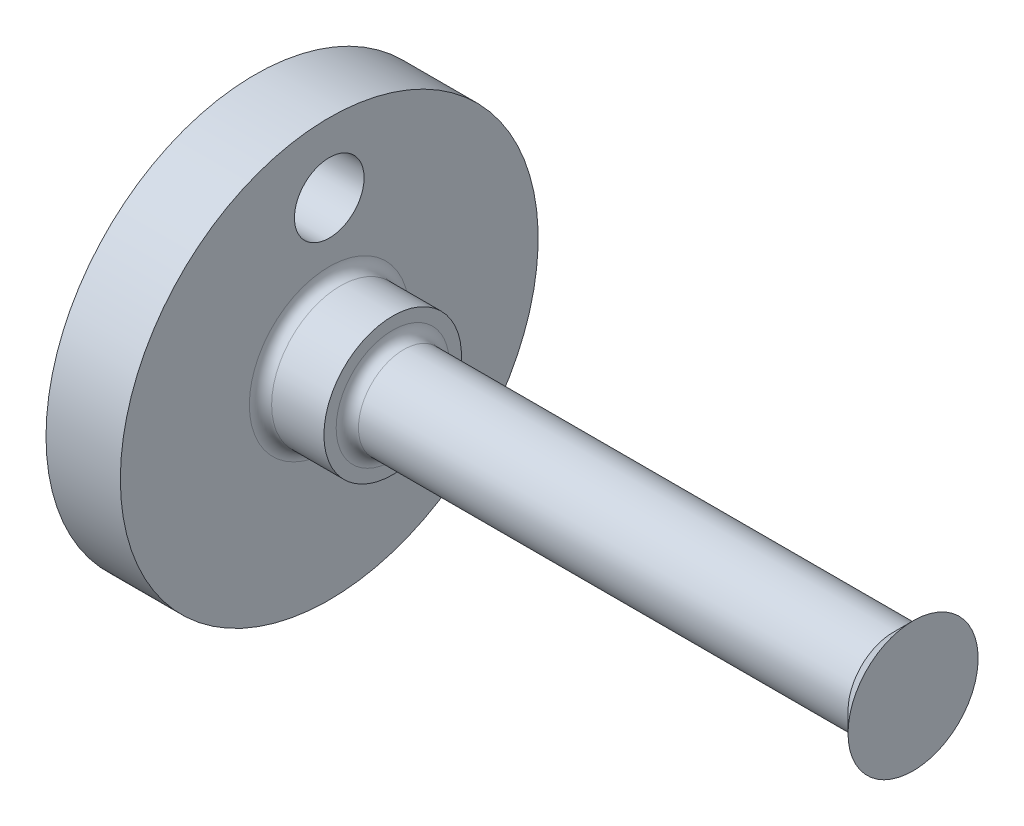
ISO-10303-21;
HEADER;
FILE_DESCRIPTION(('STEP AP214'),'2;1');
FILE_NAME('part.step','',(''),(''),'','','');
FILE_SCHEMA(('AUTOMOTIVE_DESIGN { 1 0 10303 214 1 1 1 1 }'));
ENDSEC;
DATA;
#1=APPLICATION_CONTEXT('core data for automotive mechanical design processes');
#2=APPLICATION_PROTOCOL_DEFINITION('international standard','automotive_design',2000,#1);
#3=PRODUCT_CONTEXT('',#1,'mechanical');
#4=PRODUCT('Part','Part','',(#3));
#5=PRODUCT_RELATED_PRODUCT_CATEGORY('part','',(#4));
#6=PRODUCT_DEFINITION_FORMATION('','',#4);
#7=PRODUCT_DEFINITION_CONTEXT('part definition',#1,'design');
#8=PRODUCT_DEFINITION('design','',#6,#7);
#9=PRODUCT_DEFINITION_SHAPE('','',#8);
#10=(LENGTH_UNIT() NAMED_UNIT(*) SI_UNIT(.MILLI.,.METRE.));
#11=(NAMED_UNIT(*) PLANE_ANGLE_UNIT() SI_UNIT($,.RADIAN.));
#12=(NAMED_UNIT(*) SI_UNIT($,.STERADIAN.) SOLID_ANGLE_UNIT());
#13=UNCERTAINTY_MEASURE_WITH_UNIT(LENGTH_MEASURE(1.E-05),#10,'distance_accuracy_value','');
#14=(GEOMETRIC_REPRESENTATION_CONTEXT(3) GLOBAL_UNCERTAINTY_ASSIGNED_CONTEXT((#13)) GLOBAL_UNIT_ASSIGNED_CONTEXT((#10,
#11,#12)) REPRESENTATION_CONTEXT('',''));
#15=CARTESIAN_POINT('',(0.,0.,0.));
#16=DIRECTION('',(0.,0.,1.));
#17=DIRECTION('',(1.,0.,0.));
#18=AXIS2_PLACEMENT_3D('',#15,#16,#17);
#19=CARTESIAN_POINT('',(0.,0.,0.));
#20=DIRECTION('',(1.,0.,0.));
#21=DIRECTION('',(0.,0.,-1.));
#22=AXIS2_PLACEMENT_3D('',#19,#20,#21);
#23=PLANE('',#22);
#24=CARTESIAN_POINT('',(0.,4.7625,0.));
#25=DIRECTION('',(1.,0.,0.));
#26=DIRECTION('',(0.,0.,-1.));
#27=AXIS2_PLACEMENT_3D('',#24,#25,#26);
#28=CIRCLE('',#27,1.18999);
#29=CARTESIAN_POINT('',(0.,4.7625,-1.18999));
#30=VERTEX_POINT('',#29);
#31=EDGE_CURVE('E65',#30,#30,#28,.F.);
#32=ORIENTED_EDGE('',*,*,#31,.F.);
#33=EDGE_LOOP('',(#32));
#34=FACE_BOUND('',#33,.T.);
#35=CARTESIAN_POINT('',(0.,0.,0.));
#36=DIRECTION('',(-1.,0.,0.));
#37=DIRECTION('',(0.,0.,1.));
#38=AXIS2_PLACEMENT_3D('',#35,#36,#37);
#39=CIRCLE('',#38,7.1374);
#40=CARTESIAN_POINT('',(0.,0.,7.1374));
#41=VERTEX_POINT('',#40);
#42=EDGE_CURVE('E62',#41,#41,#39,.T.);
#43=ORIENTED_EDGE('',*,*,#42,.T.);
#44=EDGE_LOOP('',(#43));
#45=FACE_BOUND('',#44,.T.);
#46=ADVANCED_FACE('F31',(#34,#45),#23,.F.);
#47=CARTESIAN_POINT('',(22.48662,0.,0.));
#48=DIRECTION('',(-1.,0.,0.));
#49=DIRECTION('',(0.,0.,1.));
#50=AXIS2_PLACEMENT_3D('',#47,#48,#49);
#51=PLANE('',#50);
#52=CARTESIAN_POINT('',(22.48662,0.,0.));
#53=DIRECTION('',(-1.,0.,0.));
#54=DIRECTION('',(0.,0.,1.));
#55=AXIS2_PLACEMENT_3D('',#52,#53,#54);
#56=CIRCLE('',#55,2.2225);
#57=CARTESIAN_POINT('',(22.48662,0.,2.2225));
#58=VERTEX_POINT('',#57);
#59=EDGE_CURVE('E10',#58,#58,#56,.T.);
#60=ORIENTED_EDGE('',*,*,#59,.F.);
#61=EDGE_LOOP('',(#60));
#62=FACE_BOUND('',#61,.T.);
#63=ADVANCED_FACE('F115',(#62),#51,.F.);
#64=CARTESIAN_POINT('',(22.48662,0.,0.));
#65=DIRECTION('',(1.,0.,0.));
#66=DIRECTION('',(0.,0.,-1.));
#67=AXIS2_PLACEMENT_3D('',#64,#65,#66);
#68=CONICAL_SURFACE('',#67,2.2225,0.785398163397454);
#69=CARTESIAN_POINT('',(21.81352,0.,0.));
#70=DIRECTION('',(-1.,0.,0.));
#71=DIRECTION('',(0.,0.,1.));
#72=AXIS2_PLACEMENT_3D('',#69,#70,#71);
#73=CIRCLE('',#72,1.5494);
#74=CARTESIAN_POINT('',(21.81352,0.,1.5494));
#75=VERTEX_POINT('',#74);
#76=EDGE_CURVE('E37',#75,#75,#73,.T.);
#77=ORIENTED_EDGE('',*,*,#76,.F.);
#78=EDGE_LOOP('',(#77));
#79=FACE_BOUND('',#78,.T.);
#80=ORIENTED_EDGE('',*,*,#59,.T.);
#81=EDGE_LOOP('',(#80));
#82=FACE_BOUND('',#81,.T.);
#83=ADVANCED_FACE('F110',(#79,#82),#68,.T.);
#84=CARTESIAN_POINT('',(0.,0.,0.));
#85=DIRECTION('',(-1.,0.,0.));
#86=DIRECTION('',(0.,0.,1.));
#87=AXIS2_PLACEMENT_3D('',#84,#85,#86);
#88=CYLINDRICAL_SURFACE('',#87,1.5494);
#89=CARTESIAN_POINT('',(5.08762,0.,0.));
#90=DIRECTION('',(-1.,0.,0.));
#91=DIRECTION('',(0.,0.,1.));
#92=AXIS2_PLACEMENT_3D('',#89,#90,#91);
#93=CIRCLE('',#92,1.5494);
#94=CARTESIAN_POINT('',(5.08762,0.,1.5494));
#95=VERTEX_POINT('',#94);
#96=EDGE_CURVE('E41',#95,#95,#93,.T.);
#97=ORIENTED_EDGE('',*,*,#96,.F.);
#98=EDGE_LOOP('',(#97));
#99=FACE_BOUND('',#98,.T.);
#100=ORIENTED_EDGE('',*,*,#76,.T.);
#101=EDGE_LOOP('',(#100));
#102=FACE_BOUND('',#101,.T.);
#103=ADVANCED_FACE('F105',(#99,#102),#88,.T.);
#104=CARTESIAN_POINT('',(5.08762,0.,0.));
#105=DIRECTION('',(-1.,0.,0.));
#106=DIRECTION('',(0.,0.,1.));
#107=AXIS2_PLACEMENT_3D('',#104,#105,#106);
#108=TOROIDAL_SURFACE('',#107,1.9304,0.381);
#109=CARTESIAN_POINT('',(4.70662,0.,0.));
#110=DIRECTION('',(-1.,0.,0.));
#111=DIRECTION('',(0.,0.,1.));
#112=AXIS2_PLACEMENT_3D('',#109,#110,#111);
#113=CIRCLE('',#112,1.9304);
#114=CARTESIAN_POINT('',(4.70662,0.,1.9304));
#115=VERTEX_POINT('',#114);
#116=EDGE_CURVE('E45',#115,#115,#113,.T.);
#117=ORIENTED_EDGE('',*,*,#116,.F.);
#118=EDGE_LOOP('',(#117));
#119=FACE_BOUND('',#118,.T.);
#120=ORIENTED_EDGE('',*,*,#96,.T.);
#121=EDGE_LOOP('',(#120));
#122=FACE_BOUND('',#121,.T.);
#123=ADVANCED_FACE('F99',(#119,#122),#108,.F.);
#124=CARTESIAN_POINT('',(4.70662,2.3495,0.));
#125=DIRECTION('',(-1.,0.,0.));
#126=DIRECTION('',(0.,0.,1.));
#127=AXIS2_PLACEMENT_3D('',#124,#125,#126);
#128=PLANE('',#127);
#129=CARTESIAN_POINT('',(4.70662,0.,0.));
#130=DIRECTION('',(-1.,0.,0.));
#131=DIRECTION('',(0.,0.,1.));
#132=AXIS2_PLACEMENT_3D('',#129,#130,#131);
#133=CIRCLE('',#132,2.3495);
#134=CARTESIAN_POINT('',(4.70662,0.,2.3495));
#135=VERTEX_POINT('',#134);
#136=EDGE_CURVE('E50',#135,#135,#133,.T.);
#137=ORIENTED_EDGE('',*,*,#136,.F.);
#138=EDGE_LOOP('',(#137));
#139=FACE_BOUND('',#138,.T.);
#140=ORIENTED_EDGE('',*,*,#116,.T.);
#141=EDGE_LOOP('',(#140));
#142=FACE_BOUND('',#141,.T.);
#143=ADVANCED_FACE('F93',(#139,#142),#128,.F.);
#144=CARTESIAN_POINT('',(0.,0.,0.));
#145=DIRECTION('',(-1.,0.,0.));
#146=DIRECTION('',(0.,0.,1.));
#147=AXIS2_PLACEMENT_3D('',#144,#145,#146);
#148=CYLINDRICAL_SURFACE('',#147,2.3495);
#149=CARTESIAN_POINT('',(2.921,0.,0.));
#150=DIRECTION('',(-1.,0.,0.));
#151=DIRECTION('',(0.,0.,1.));
#152=AXIS2_PLACEMENT_3D('',#149,#150,#151);
#153=CIRCLE('',#152,2.3495);
#154=CARTESIAN_POINT('',(2.921,0.,2.3495));
#155=VERTEX_POINT('',#154);
#156=EDGE_CURVE('E53',#155,#155,#153,.T.);
#157=ORIENTED_EDGE('',*,*,#156,.F.);
#158=EDGE_LOOP('',(#157));
#159=FACE_BOUND('',#158,.T.);
#160=ORIENTED_EDGE('',*,*,#136,.T.);
#161=EDGE_LOOP('',(#160));
#162=FACE_BOUND('',#161,.T.);
#163=ADVANCED_FACE('F87',(#159,#162),#148,.T.);
#164=CARTESIAN_POINT('',(2.921,0.,0.));
#165=DIRECTION('',(-1.,0.,0.));
#166=DIRECTION('',(0.,0.,1.));
#167=AXIS2_PLACEMENT_3D('',#164,#165,#166);
#168=TOROIDAL_SURFACE('',#167,2.7305,0.381);
#169=CARTESIAN_POINT('',(2.54,0.,0.));
#170=DIRECTION('',(-1.,0.,0.));
#171=DIRECTION('',(0.,0.,1.));
#172=AXIS2_PLACEMENT_3D('',#169,#170,#171);
#173=CIRCLE('',#172,2.7305);
#174=CARTESIAN_POINT('',(2.54,0.,2.7305));
#175=VERTEX_POINT('',#174);
#176=EDGE_CURVE('E56',#175,#175,#173,.T.);
#177=ORIENTED_EDGE('',*,*,#176,.F.);
#178=EDGE_LOOP('',(#177));
#179=FACE_BOUND('',#178,.T.);
#180=ORIENTED_EDGE('',*,*,#156,.T.);
#181=EDGE_LOOP('',(#180));
#182=FACE_BOUND('',#181,.T.);
#183=ADVANCED_FACE('F79',(#179,#182),#168,.F.);
#184=CARTESIAN_POINT('',(2.54,7.1374,0.));
#185=DIRECTION('',(-1.,0.,0.));
#186=DIRECTION('',(0.,0.,1.));
#187=AXIS2_PLACEMENT_3D('',#184,#185,#186);
#188=PLANE('',#187);
#189=CARTESIAN_POINT('',(2.54,4.7625,0.));
#190=DIRECTION('',(1.,0.,0.));
#191=DIRECTION('',(0.,0.,-1.));
#192=AXIS2_PLACEMENT_3D('',#189,#190,#191);
#193=CIRCLE('',#192,1.18999);
#194=CARTESIAN_POINT('',(2.54,4.7625,-1.18999));
#195=VERTEX_POINT('',#194);
#196=EDGE_CURVE('E68',#195,#195,#193,.T.);
#197=ORIENTED_EDGE('',*,*,#196,.F.);
#198=EDGE_LOOP('',(#197));
#199=FACE_BOUND('',#198,.T.);
#200=CARTESIAN_POINT('',(2.54,0.,0.));
#201=DIRECTION('',(-1.,0.,0.));
#202=DIRECTION('',(0.,0.,1.));
#203=AXIS2_PLACEMENT_3D('',#200,#201,#202);
#204=CIRCLE('',#203,7.1374);
#205=CARTESIAN_POINT('',(2.54,0.,7.1374));
#206=VERTEX_POINT('',#205);
#207=EDGE_CURVE('E59',#206,#206,#204,.T.);
#208=ORIENTED_EDGE('',*,*,#207,.F.);
#209=EDGE_LOOP('',(#208));
#210=FACE_BOUND('',#209,.T.);
#211=ORIENTED_EDGE('',*,*,#176,.T.);
#212=EDGE_LOOP('',(#211));
#213=FACE_BOUND('',#212,.T.);
#214=ADVANCED_FACE('F75',(#199,#210,#213),#188,.F.);
#215=CARTESIAN_POINT('',(0.,0.,0.));
#216=DIRECTION('',(-1.,0.,0.));
#217=DIRECTION('',(0.,0.,1.));
#218=AXIS2_PLACEMENT_3D('',#215,#216,#217);
#219=CYLINDRICAL_SURFACE('',#218,7.1374);
#220=ORIENTED_EDGE('',*,*,#42,.F.);
#221=EDGE_LOOP('',(#220));
#222=FACE_BOUND('',#221,.T.);
#223=ORIENTED_EDGE('',*,*,#207,.T.);
#224=EDGE_LOOP('',(#223));
#225=FACE_BOUND('',#224,.T.);
#226=ADVANCED_FACE('F78',(#222,#225),#219,.T.);
#227=CARTESIAN_POINT('',(-0.00100000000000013,4.7625,0.));
#228=DIRECTION('',(1.,0.,0.));
#229=DIRECTION('',(0.,0.,-1.));
#230=AXIS2_PLACEMENT_3D('',#227,#228,#229);
#231=CYLINDRICAL_SURFACE('',#230,1.18999);
#232=ORIENTED_EDGE('',*,*,#196,.T.);
#233=EDGE_LOOP('',(#232));
#234=FACE_BOUND('',#233,.T.);
#235=ORIENTED_EDGE('',*,*,#31,.T.);
#236=EDGE_LOOP('',(#235));
#237=FACE_BOUND('',#236,.T.);
#238=ADVANCED_FACE('F72',(#234,#237),#231,.F.);
#239=CLOSED_SHELL('',(#46,#63,#83,#103,#123,#143,#163,#183,#214,#226,#238));
#240=MANIFOLD_SOLID_BREP('B2',#239);
#241=ADVANCED_BREP_SHAPE_REPRESENTATION('',(#18,#240),#14);
#242=SHAPE_DEFINITION_REPRESENTATION(#9,#241);
ENDSEC;
END-ISO-10303-21;
